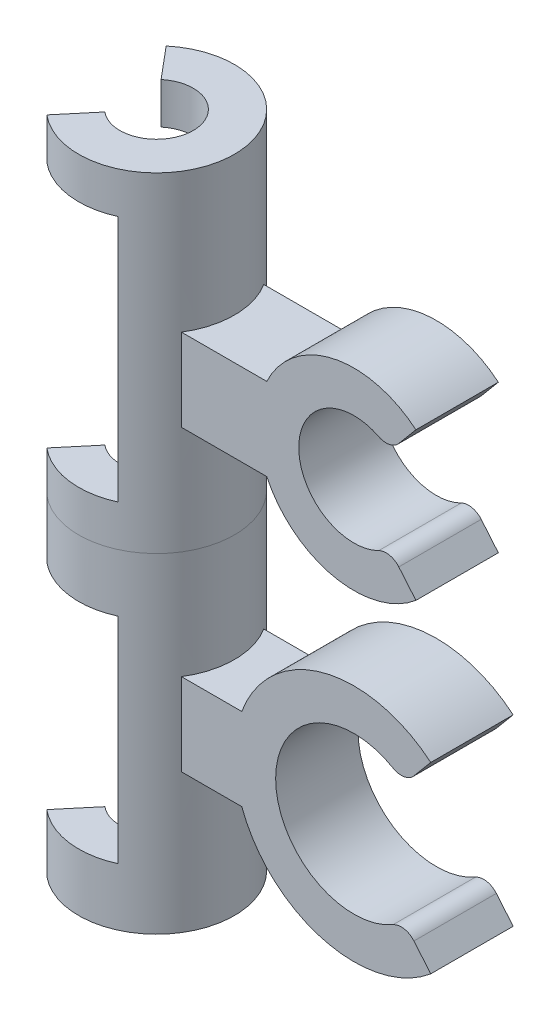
from build123d import *

# Parameters (mm, degrees)
BOSS_EXTRUDE1_DEPTH     = 40
BOSS_EXTRUDE2_DEPTH     = 5
CUT_EXTRUDE1_DEPTH      = 57.159839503
CUT_EXTRUDE1_DEPTH_BACK = 57.159839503
SKETCH5_W               = 10
SKETCH5_H               = 4
SKETCH5_H_2             = 22
SKETCH5_H_3             = 18
FILLET1_R               = 2


with BuildPart() as part:
    # Sketch1 → Boss-Extrude1 (new, symmetric)
    with BuildSketch(Plane(origin=(0, 0, 0), x_dir=(1, 0, 0), z_dir=(0, 1, 0))):
        with BuildLine():
            Line((-2.860404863, 3.408897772), (-6.074342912, 7.239119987))
            ThreePointArc((-6.074342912, 7.239119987), (9.45, 0), (-6.074342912, -7.239119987))
            Line((-6.074342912, -7.239119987), (-2.860404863, -3.408897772))
            ThreePointArc((-2.860404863, -3.408897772), (4.45, 0), (-2.860404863, 3.408897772))
        make_face()
    extrude(amount=BOSS_EXTRUDE1_DEPTH, both=True)

    # Sketch2 → Boss-Extrude2 (add, symmetric)
    with BuildSketch(Plane.XY):
        with BuildLine():
            ThreePointArc((18.372193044, 13.1), (17.25, 18.1), (18.372193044, 23.1))
            Line((18.372193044, 23.1), (4.45, 23.1))
            Line((4.45, 23.1), (4.45, 13.1))
            Line((4.45, 13.1), (18.372193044, 13.1))
        make_face()
        with BuildLine():
            Line((36.470615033, 27.062719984), (33.256676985, 23.232497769))
            ThreePointArc((33.256676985, 23.232497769), (22.25, 18.1), (33.256676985, 12.967502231))
            Line((33.256676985, 12.967502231), (36.470615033, 9.137280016))
            ThreePointArc((36.470615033, 9.137280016), (17.25, 18.1), (36.470615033, 27.062719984))
        make_face()
        with BuildLine():
            Line((4.45, -23.1), (15.339342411, -23.1))
            ThreePointArc((15.339342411, -23.1), (14.45, -18.1), (15.339342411, -13.1))
            Line((15.339342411, -13.1), (4.45, -13.1))
            Line((4.45, -13.1), (4.45, -23.1))
        make_face()
        with BuildLine():
            Line((38.27042034, -6.992355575), (35.056482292, -10.82257779))
            ThreePointArc((35.056482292, -10.82257779), (19.45, -18.1), (35.056482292, -25.37742221))
            Line((35.056482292, -25.37742221), (38.27042034, -29.207644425))
            ThreePointArc((38.27042034, -29.207644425), (14.45, -18.1), (38.27042034, -6.992355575))
        make_face()
    extrude(amount=BOSS_EXTRUDE2_DEPTH, both=True)

    # Sketch5 → Cut-Extrude1 (cut, two sides: drawn at the far end of the back side and taken through both)
    with BuildSketch(Plane.XY.offset(-CUT_EXTRUDE1_DEPTH_BACK)):
        with Locations((-1.074342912, 33)):
            Rectangle(SKETCH5_W, SKETCH5_H)
        with Locations((-1.074342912, 20)):
            Rectangle(SKETCH5_W, SKETCH5_H_2)
        with Locations((-1.074342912, 7)):
            Rectangle(SKETCH5_W, SKETCH5_H)
        with Locations((-1.074342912, -9)):
            Rectangle(SKETCH5_W, SKETCH5_H)
        with Locations((-1.074342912, -20)):
            Rectangle(SKETCH5_W, SKETCH5_H_3)
        with Locations((-1.074342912, -31)):
            Rectangle(SKETCH5_W, SKETCH5_H)
    extrude(amount=CUT_EXTRUDE1_DEPTH + CUT_EXTRUDE1_DEPTH_BACK, mode=Mode.SUBTRACT)

    # Fillet1
    fillet1_edges = [part.edges().sort_by_distance(p)[0] for p in [
        (33.256676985, 12.967502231, 0),
        (33.256676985, 23.232497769, 0),
        (35.056482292, -25.37742221, 0),
        (35.056482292, -10.82257779, 0),
    ]]
    fillet(fillet1_edges, radius=FILLET1_R)


with BuildPart() as body_2:
    # Split1: the piece on the far side of the plane
    add(part.part)
    split(bisect_by=Plane.ZX, keep=Keep.BOTTOM)


with BuildPart() as part_1:
    add(part.part)

    # Split1
    split(bisect_by=Plane.ZX, keep=Keep.TOP)


solid = Compound([body_2.part, part_1.part])
